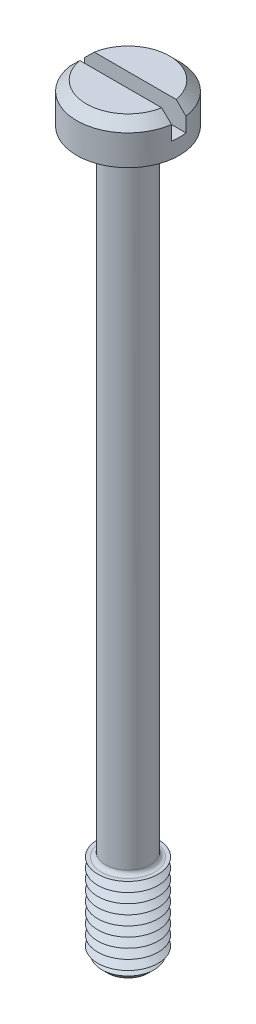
from build123d import *

# Parameters (mm, degrees)
SKETCH1_R           = 4.25
BOSS_EXTRUDE1_DEPTH = 3.3
SKETCH2_R           = 1.85
BOSS_EXTRUDE2_DEPTH = 60
SKETCH3_R           = 2.5
BOSS_EXTRUDE3_DEPTH = 7.5
CHAMFER1_SIZE       = 0.8
LPATTERN1_COUNT     = 9
LPATTERN1_PITCH     = 0.8
FILLET1_R           = 0.35
CHAMFER2_SIZE       = 0.8
SKETCH6_W           = 8.5
SKETCH6_H           = 1.2
CUT_EXTRUDE1_DEPTH  = 2


with BuildPart() as part:
    # Sketch1 → Boss-Extrude1 (new body)
    with BuildSketch(Plane(origin=(0, 0, 0), x_dir=(1, 0, 0), z_dir=(0, 1, 0))):
        with Locations(Location((0, 0, 0), (0, 0, 270))):
            Circle(SKETCH1_R)
    extrude(amount=BOSS_EXTRUDE1_DEPTH)

    # Sketch2 → Boss-Extrude2 (add)
    with BuildSketch(Plane.XZ):
        with Locations(Location((0, 0, 0), (0, 0, 270))):
            Circle(SKETCH2_R)
    extrude(amount=BOSS_EXTRUDE2_DEPTH)

    # Sketch3 → Boss-Extrude3 (add)
    with BuildSketch(Plane.XZ.offset(60)):
        with Locations(Location((0, 0, 0), (0, 0, 270))):
            Circle(SKETCH3_R)
    extrude(amount=-BOSS_EXTRUDE3_DEPTH)

    # Chamfer1
    chamfer1_edges = [part.edges().sort_by_distance(p)[0] for p in [
        (0, -60, 2.5),
    ]]
    chamfer(chamfer1_edges, length=CHAMFER1_SIZE)

    # Sketch5 → Cut-Revolve1 (revolve, cut)
    with BuildSketch(Plane(origin=(0, 0, 0), x_dir=(0, 0, -1), z_dir=(1, 0, 0))):
        Polygon((-2.5, -52.5), (-1.807179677, -52.9), (-2.5, -53.3), align=None)
    cut_revolve1 = revolve(axis=Axis((0, -6.58711856, 0), (0, -1, 0)), mode=Mode.SUBTRACT)

    # LPattern1: Cut-Revolve1 ×9
    with Locations(*[(0, -i * LPATTERN1_PITCH, 0) for i in range(1, LPATTERN1_COUNT)]):
        add(cut_revolve1, mode=Mode.SUBTRACT)

    # Fillet1
    fillet1_edges = [part.edges().sort_by_distance(p)[0] for p in [
        (0, 0, 1.85),
        (0, -52.5, 1.85),
    ]]
    fillet(fillet1_edges, radius=FILLET1_R)

    # Chamfer2
    chamfer2_edges = [part.edges().sort_by_distance(p)[0] for p in [
        (0, 3.3, -4.25),
    ]]
    chamfer(chamfer2_edges, length=CHAMFER2_SIZE)

    # Sketch6 → Cut-Extrude1 (cut)
    with BuildSketch(Plane(origin=(0, 3.3, 0), x_dir=(1, 0, 0), z_dir=(0, 1, 0))):
        Rectangle(SKETCH6_W, SKETCH6_H)
    extrude(amount=-CUT_EXTRUDE1_DEPTH, mode=Mode.SUBTRACT)


solid = part.part
